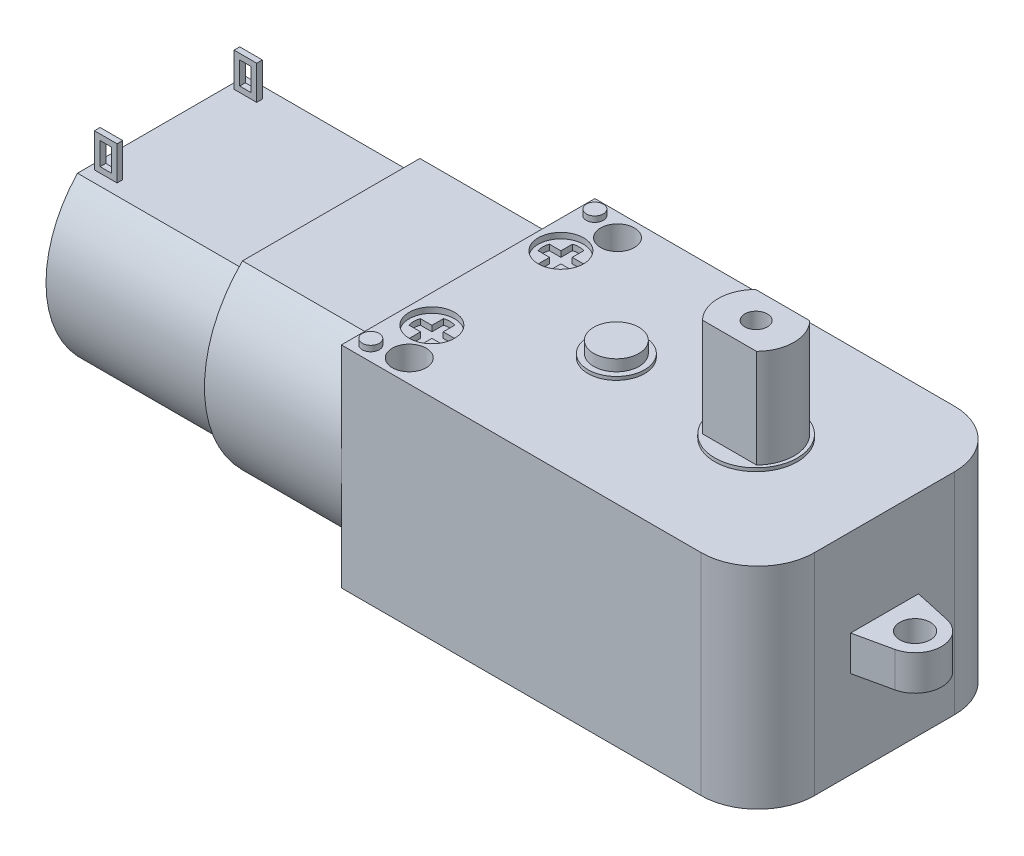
from build123d import *

# Parameters (mm, degrees)
SKETCH1_W       = 36.8
SKETCH1_H       = 22.4
EXTRUDE1_DEPTH  = 9.3
FILLET1_R       = 5
SKETCH2_R       = 1.35
EXTRUDE2_DEPTH  = 1.55
SKETCH3_R       = 3.65
SKETCH3_R_2     = 2.5
EXTRUDE3_DEPTH  = 0.3
SKETCH4_R       = 1
EXTRUDE4_DEPTH  = 8.7
SKETCH6_R       = 2
EXTRUDE5_DEPTH  = 1
SKETCH7_R       = 1.5
EXTRUDE6_DEPTH  = 51.981785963
SKETCH8_R       = 2
EXTRUDE7_DEPTH  = 0.5
EXTRUDE8_DEPTH  = 0.5
SKETCH10_R      = 0.75
EXTRUDE9_DEPTH  = 0.5
EXTRUDE11_DEPTH = 12.1
EXTRUDE12_DEPTH = 15
SKETCH14_R      = 4
EXTRUDE13_DEPTH = 1
SKETCH15_R      = 1
EXTRUDE14_DEPTH = 1
SKETCH16_W      = 2
SKETCH16_H      = 0.5
EXTRUDE15_DEPTH = 3
SKETCH17_W      = 1
SKETCH17_H      = 2
EXTRUDE16_DEPTH = 49.956490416


with BuildPart() as part:
    # Sketch1 → Extrude1 (new, symmetric)
    with BuildSketch(Plane(origin=(0, 0, 0), x_dir=(1, 0, 0), z_dir=(0, 1, 0))):
        with Locations((18.4, 11.2)):
            Rectangle(SKETCH1_W, SKETCH1_H)
    extrude(amount=EXTRUDE1_DEPTH, both=True)

    # Fillet1
    fillet1_edges = [part.edges().sort_by_distance(p)[0] for p in [
        (36.8, 0, -22.4),
        (36.8, 0, 0),
    ]]
    fillet(fillet1_edges, radius=FILLET1_R)

    # Sketch2 → Extrude2 (add, symmetric)
    with BuildSketch(Plane(origin=(0, 0, 0), x_dir=(1, 0, 0), z_dir=(0, 1, 0))):
        with BuildLine():
            Line((36.8, 14.2), (40.004789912, 13.495144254))
            ThreePointArc((40.004789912, 13.495144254), (41.85, 11.2), (40.004789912, 8.904855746))
            Line((40.004789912, 8.904855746), (36.8, 8.2))
            Line((36.8, 8.2), (36.8, 14.2))
        make_face()
        with Locations(Location((39.5, 11.2, 0), (0, 0, 90))):
            Circle(SKETCH2_R, mode=Mode.SUBTRACT)
    extrude(amount=EXTRUDE2_DEPTH, both=True)

    # Sketch3 → Extrude3 (add)
    with BuildSketch(Plane(origin=(0, 9.3, 0), x_dir=(1, 0, 0), z_dir=(0, 1, 0))):
        with Locations(Location((25.45, 11.2, 0), (0, 0, 90))):
            Circle(SKETCH3_R)
        with Locations(Location((13.1, 11.2, 0), (0, 0, 90))):
            Circle(SKETCH3_R_2)
    extrude(amount=EXTRUDE3_DEPTH)

    # Sketch4 → Extrude4 (add)
    with BuildSketch(Plane(origin=(0, 9.6, 0), x_dir=(1, 0, 0), z_dir=(0, 1, 0))):
        with BuildLine():
            Line((23.062532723, 8.85), (27.837467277, 8.85))
            ThreePointArc((27.837467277, 8.85), (28.8, 11.2), (27.837467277, 13.55))
            Line((27.837467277, 13.55), (23.062532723, 13.55))
            ThreePointArc((23.062532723, 13.55), (22.1, 11.2), (23.062532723, 8.85))
        make_face()
        with Locations(Location((25.45, 11.2, 0), (0, 0, 270))):
            Circle(SKETCH4_R, mode=Mode.SUBTRACT)
    extrude(amount=EXTRUDE4_DEPTH)

    # Sketch6 → Extrude5 (add)
    with BuildSketch(Plane(origin=(0, 9.6, 0), x_dir=(1, 0, 0), z_dir=(0, 1, 0))):
        with Locations(Location((13.1, 11.2, 0), (0, 0, 270))):
            Circle(SKETCH6_R)
    extrude(amount=EXTRUDE5_DEPTH)

    # Sketch7 → Extrude6 (cut, through all)
    with BuildSketch(Plane(origin=(0, 9.3, 0), x_dir=(1, 0, 0), z_dir=(0, 1, 0))):
        with Locations(Location((4, 20.4, 0), (0, 0, 270))):
            Circle(SKETCH7_R)
        with Locations(Location((4, 2, 0), (0, 0, 270))):
            Circle(SKETCH7_R)
    extrude(amount=-EXTRUDE6_DEPTH, mode=Mode.SUBTRACT)

    # Sketch8 → Extrude7 (cut)
    with BuildSketch(Plane(origin=(0, 9.3, 0), x_dir=(1, 0, 0), z_dir=(0, 1, 0))):
        with Locations(Location((2.5, 16.9, 0), (0, 0, 270))):
            Circle(SKETCH8_R)
        with Locations(Location((2.5, 5.5, 0), (0, 0, 270))):
            Circle(SKETCH8_R)
    extrude(amount=-EXTRUDE7_DEPTH, mode=Mode.SUBTRACT)

    # Sketch9 → Extrude8 (cut)
    with BuildSketch(Plane(origin=(0, 8.8, 0), x_dir=(1, 0, 0), z_dir=(0, 1, 0))):
        with BuildLine():
            Line((2, 7.019868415), (2, 6))
            Line((2, 6), (0.980131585, 6))
            ThreePointArc((0.980131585, 6), (0.9, 5.5), (0.980131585, 5))
            Line((0.980131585, 5), (2, 5))
            Line((2, 5), (2, 3.980131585))
            ThreePointArc((2, 3.980131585), (2.5, 3.9), (3, 3.980131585))
            Line((3, 3.980131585), (3, 5))
            Line((3, 5), (4.019868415, 5))
            ThreePointArc((4.019868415, 5), (4.1, 5.5), (4.019868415, 6))
            Line((4.019868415, 6), (3, 6))
            Line((3, 6), (3, 7.019868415))
            ThreePointArc((3, 7.019868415), (2.5, 7.1), (2, 7.019868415))
        make_face()
        with BuildLine():
            Line((4.019868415, 17.4), (3, 17.4))
            Line((3, 17.4), (3, 18.419868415))
            ThreePointArc((3, 18.419868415), (2.5, 18.5), (2, 18.419868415))
            Line((2, 18.419868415), (2, 17.4))
            Line((2, 17.4), (0.980131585, 17.4))
            ThreePointArc((0.980131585, 17.4), (0.9, 16.9), (0.980131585, 16.4))
            Line((0.980131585, 16.4), (2, 16.4))
            Line((2, 16.4), (2, 15.380131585))
            ThreePointArc((2, 15.380131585), (2.5, 15.3), (3, 15.380131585))
            Line((3, 15.380131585), (3, 16.4))
            Line((3, 16.4), (4.019868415, 16.4))
            ThreePointArc((4.019868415, 16.4), (4.1, 16.9), (4.019868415, 17.4))
        make_face()
    extrude(amount=-EXTRUDE8_DEPTH, mode=Mode.SUBTRACT)

    # Sketch10 → Extrude9 (add)
    with BuildSketch(Plane(origin=(0, 9.3, 0), x_dir=(1, 0, 0), z_dir=(0, 1, 0))):
        with Locations(Location((1.3, 21.1, 0), (0, 0, 90))):
            Circle(SKETCH10_R)
        with Locations(Location((1.3, 1.3, 0), (0, 0, 90))):
            Circle(SKETCH10_R)
    extrude(amount=EXTRUDE9_DEPTH)

    # Sketch12 → Extrude11 (add)
    with BuildSketch(Plane.ZY):
        with BuildLine():
            Line((-19.038367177, 8), (-3.361632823, 8))
            ThreePointArc((-3.361632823, 8), (0, 0), (-3.361632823, -8))
            Line((-3.361632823, -8), (-19.038367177, -8))
            ThreePointArc((-19.038367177, -8), (-22.4, 0), (-19.038367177, 8))
        make_face()
    extrude(amount=EXTRUDE11_DEPTH)

    # Sketch13 → Extrude12 (add)
    with BuildSketch(Plane.ZY.offset(12.1)):
        with BuildLine():
            Line((-18.618894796, -7), (-3.781105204, -7))
            ThreePointArc((-3.781105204, -7), (-1, 0), (-3.781105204, 7))
            Line((-3.781105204, 7), (-18.618894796, 7))
            ThreePointArc((-18.618894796, 7), (-21.4, 0), (-18.618894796, -7))
        make_face()
    extrude(amount=EXTRUDE12_DEPTH)

    # Sketch14 → Extrude13 (add)
    with BuildSketch(Plane.ZY.offset(27.1)):
        with Locations((-11.2, 0)):
            Circle(SKETCH14_R)
    extrude(amount=EXTRUDE13_DEPTH)

    # Sketch15 → Extrude14 (add)
    with BuildSketch(Plane.ZY.offset(28.1)):
        with Locations((-11.2, 0)):
            Circle(SKETCH15_R)
    extrude(amount=EXTRUDE14_DEPTH)

    # Sketch16 → Extrude15 (add)
    with BuildSketch(Plane(origin=(0, 7, 0), x_dir=(1, 0, 0), z_dir=(0, 1, 0))):
        with Locations((-25.6, 17.368894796)):
            Rectangle(SKETCH16_W, SKETCH16_H)
        with Locations((-25.6, 5.031105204)):
            Rectangle(SKETCH16_W, SKETCH16_H)
    extrude(amount=EXTRUDE15_DEPTH)

    # Sketch17 → Extrude16 (cut, through all)
    with BuildSketch(Plane.XY.offset(-4.781105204)):
        with Locations((-25.6, 8.5)):
            Rectangle(SKETCH17_W, SKETCH17_H)
    extrude(amount=-EXTRUDE16_DEPTH, mode=Mode.SUBTRACT)


solid = part.part
